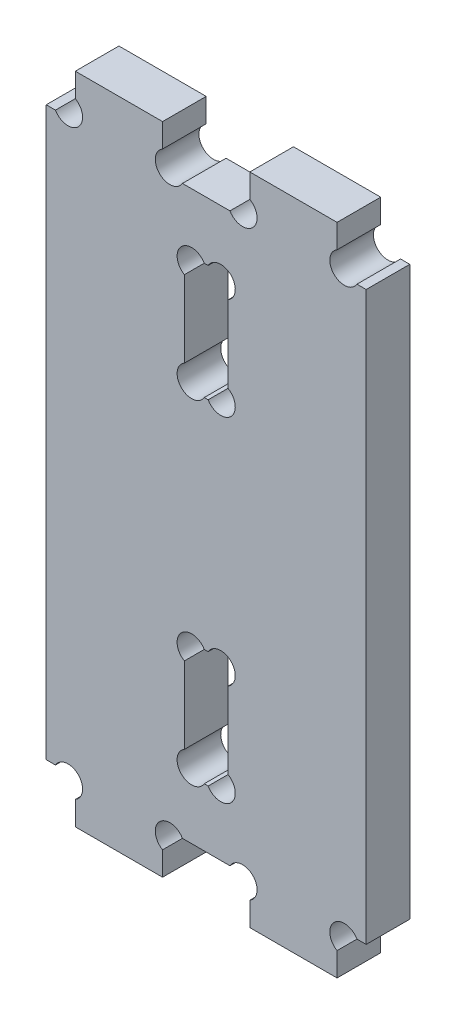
from build123d import *

# Parameters (mm, degrees)
SKETCH_1_W            = 22
SKETCH_1_H            = 39
EXTRUDE_1_DEPTH       = 3
SKETCH_2_W            = 3
SKETCH_2_H            = 8
CUT_EXTRUDE_1_DEPTH   = 4
SKETCH_3_W            = 6
SKETCH_3_H            = 3
EXTRUDE_2_DEPTH       = 3
HOLE_WIZARD_2_0_2_1_D = 2


with BuildPart() as part:
    # Sketch 1 → Extrude 1 (new body)
    with BuildSketch(Plane.XY):
        Rectangle(SKETCH_1_W, SKETCH_1_H)
    extrude(amount=EXTRUDE_1_DEPTH)

    # Sketch 2 → Cut-Extrude 1 (cut)
    with BuildSketch(Plane.XY.offset(3)):
        with Locations((0, -11.5)):
            Rectangle(SKETCH_2_W, SKETCH_2_H)
        with Locations((0, 11.5)):
            Rectangle(SKETCH_2_W, SKETCH_2_H)
    extrude(amount=-CUT_EXTRUDE_1_DEPTH, mode=Mode.SUBTRACT)

    # Sketch 3 → Extrude 2 (add)
    with BuildSketch(Plane.XY):
        with Locations((6, 21)):
            Rectangle(SKETCH_3_W, SKETCH_3_H)
        with Locations((-6, 21)):
            Rectangle(SKETCH_3_W, SKETCH_3_H)
        with Locations((6, -21)):
            Rectangle(SKETCH_3_W, SKETCH_3_H)
        with Locations((-6, -21)):
            Rectangle(SKETCH_3_W, SKETCH_3_H)
    extrude(amount=EXTRUDE_2_DEPTH)

    # Hole Wizard 2.0 _2_ _1 (through all)
    with Locations(Plane.XY.offset(3)):
        with Locations((-1, 15), (1, 15), (1, 8), (-1, 8), (-1, -8), (1, -8), (1, -15), (-1, -15), (-9.5, 20), (-2.5, 20), (2.5, 20), (9.5, 20), (9.5, -20), (2.5, -20), (-2.5, -20), (-9.5, -20)):
            Hole(HOLE_WIZARD_2_0_2_1_D / 2)


solid = part.part
